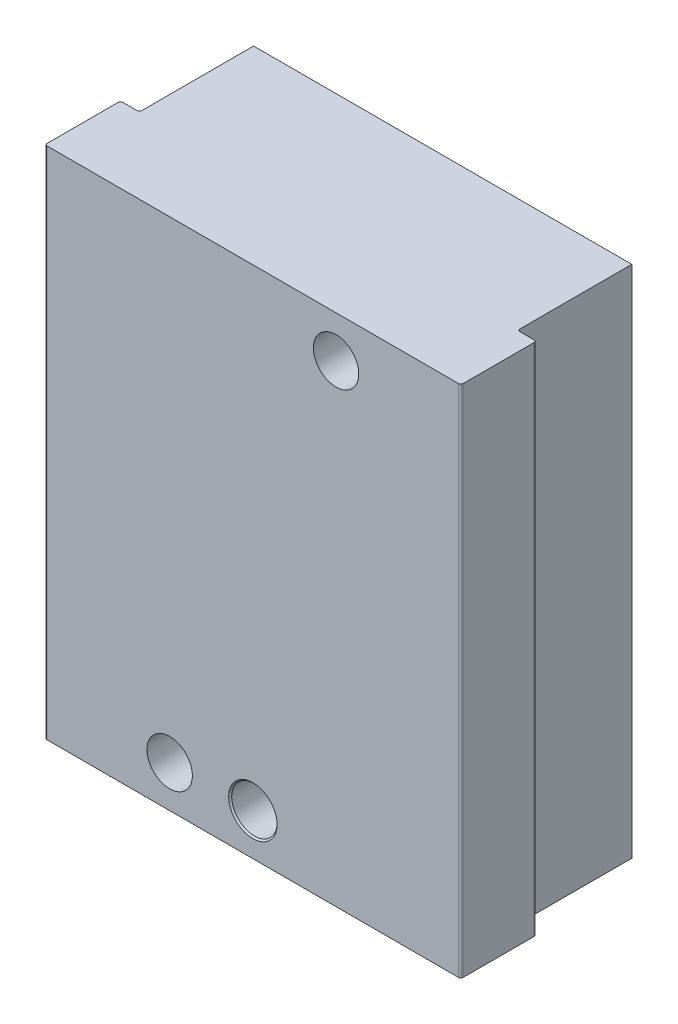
ISO-10303-21;
HEADER;
FILE_DESCRIPTION(('STEP AP214'),'2;1');
FILE_NAME('part.step','',(''),(''),'','','');
FILE_SCHEMA(('AUTOMOTIVE_DESIGN { 1 0 10303 214 1 1 1 1 }'));
ENDSEC;
DATA;
#1=APPLICATION_CONTEXT('core data for automotive mechanical design processes');
#2=APPLICATION_PROTOCOL_DEFINITION('international standard','automotive_design',2000,#1);
#3=PRODUCT_CONTEXT('',#1,'mechanical');
#4=PRODUCT('Part','Part','',(#3));
#5=PRODUCT_RELATED_PRODUCT_CATEGORY('part','',(#4));
#6=PRODUCT_DEFINITION_FORMATION('','',#4);
#7=PRODUCT_DEFINITION_CONTEXT('part definition',#1,'design');
#8=PRODUCT_DEFINITION('design','',#6,#7);
#9=PRODUCT_DEFINITION_SHAPE('','',#8);
#10=(LENGTH_UNIT() NAMED_UNIT(*) SI_UNIT(.MILLI.,.METRE.));
#11=(NAMED_UNIT(*) PLANE_ANGLE_UNIT() SI_UNIT($,.RADIAN.));
#12=(NAMED_UNIT(*) SI_UNIT($,.STERADIAN.) SOLID_ANGLE_UNIT());
#13=UNCERTAINTY_MEASURE_WITH_UNIT(LENGTH_MEASURE(1.E-05),#10,'distance_accuracy_value','');
#14=(GEOMETRIC_REPRESENTATION_CONTEXT(3) GLOBAL_UNCERTAINTY_ASSIGNED_CONTEXT((#13)) GLOBAL_UNIT_ASSIGNED_CONTEXT((#10,
#11,#12)) REPRESENTATION_CONTEXT('',''));
#15=CARTESIAN_POINT('',(0.,0.,0.));
#16=DIRECTION('',(0.,0.,1.));
#17=DIRECTION('',(1.,0.,0.));
#18=AXIS2_PLACEMENT_3D('',#15,#16,#17);
#19=CARTESIAN_POINT('',(0.,5.5,0.));
#20=DIRECTION('',(0.,0.,-1.));
#21=DIRECTION('',(-1.,0.,0.));
#22=AXIS2_PLACEMENT_3D('',#19,#20,#21);
#23=CYLINDRICAL_SURFACE('',#22,1.5);
#24=CARTESIAN_POINT('',(0.,5.5,-25.1));
#25=DIRECTION('',(0.,0.,-1.));
#26=DIRECTION('',(-1.,0.,0.));
#27=AXIS2_PLACEMENT_3D('',#24,#25,#26);
#28=CIRCLE('',#27,1.5);
#29=CARTESIAN_POINT('',(-1.5,5.5,-25.1));
#30=VERTEX_POINT('',#29);
#31=EDGE_CURVE('E248',#30,#30,#28,.T.);
#32=ORIENTED_EDGE('',*,*,#31,.T.);
#33=EDGE_LOOP('',(#32));
#34=FACE_BOUND('',#33,.T.);
#35=CARTESIAN_POINT('',(0.,5.5,-10.));
#36=DIRECTION('',(0.,0.,1.));
#37=DIRECTION('',(1.,0.,0.));
#38=AXIS2_PLACEMENT_3D('',#35,#36,#37);
#39=CIRCLE('',#38,1.5);
#40=CARTESIAN_POINT('',(1.5,5.5,-10.));
#41=VERTEX_POINT('',#40);
#42=EDGE_CURVE('E246',#41,#41,#39,.F.);
#43=ORIENTED_EDGE('',*,*,#42,.F.);
#44=EDGE_LOOP('',(#43));
#45=FACE_BOUND('',#44,.T.);
#46=ADVANCED_FACE('F32',(#34,#45),#23,.F.);
#47=CARTESIAN_POINT('',(27.5,68.,-10.));
#48=DIRECTION('',(-1.,0.,0.));
#49=DIRECTION('',(0.,0.,1.));
#50=AXIS2_PLACEMENT_3D('',#47,#48,#49);
#51=PLANE('',#50);
#52=DIRECTION('',(0.,0.,-1.));
#53=VECTOR('',#52,1.);
#54=CARTESIAN_POINT('',(27.5,0.,-10.));
#55=LINE('',#54,#53);
#56=CARTESIAN_POINT('',(27.5,0.,-0.3));
#57=VERTEX_POINT('',#56);
#58=CARTESIAN_POINT('',(27.5,0.,-9.7));
#59=VERTEX_POINT('',#58);
#60=EDGE_CURVE('E174',#57,#59,#55,.T.);
#61=ORIENTED_EDGE('',*,*,#60,.T.);
#62=DIRECTION('',(0.,-1.,0.));
#63=VECTOR('',#62,1.);
#64=CARTESIAN_POINT('',(27.5,68.,-9.7));
#65=LINE('',#64,#63);
#66=CARTESIAN_POINT('',(27.5,68.,-9.7));
#67=VERTEX_POINT('',#66);
#68=EDGE_CURVE('E212',#59,#67,#65,.F.);
#69=ORIENTED_EDGE('',*,*,#68,.T.);
#70=DIRECTION('',(0.,0.,-1.));
#71=VECTOR('',#70,1.);
#72=CARTESIAN_POINT('',(27.5,68.,-10.));
#73=LINE('',#72,#71);
#74=CARTESIAN_POINT('',(27.5,68.,-0.3));
#75=VERTEX_POINT('',#74);
#76=EDGE_CURVE('E195',#75,#67,#73,.T.);
#77=ORIENTED_EDGE('',*,*,#76,.F.);
#78=DIRECTION('',(0.,-1.,0.));
#79=VECTOR('',#78,1.);
#80=CARTESIAN_POINT('',(27.5,68.,-0.3));
#81=LINE('',#80,#79);
#82=EDGE_CURVE('E209',#75,#57,#81,.T.);
#83=ORIENTED_EDGE('',*,*,#82,.T.);
#84=EDGE_LOOP('',(#61,#69,#77,#83));
#85=FACE_BOUND('',#84,.T.);
#86=ADVANCED_FACE('F265',(#85),#51,.F.);
#87=CARTESIAN_POINT('',(27.5,68.,-10.));
#88=DIRECTION('',(0.,0.,1.));
#89=DIRECTION('',(1.,0.,0.));
#90=AXIS2_PLACEMENT_3D('',#87,#88,#89);
#91=PLANE('',#90);
#92=DIRECTION('',(-1.,0.,0.));
#93=VECTOR('',#92,1.);
#94=CARTESIAN_POINT('',(27.5,68.,-10.));
#95=LINE('',#94,#93);
#96=CARTESIAN_POINT('',(27.2,68.,-10.));
#97=VERTEX_POINT('',#96);
#98=CARTESIAN_POINT('',(25.3,68.,-10.));
#99=VERTEX_POINT('',#98);
#100=EDGE_CURVE('E147',#97,#99,#95,.T.);
#101=ORIENTED_EDGE('',*,*,#100,.F.);
#102=DIRECTION('',(0.,-1.,0.));
#103=VECTOR('',#102,1.);
#104=CARTESIAN_POINT('',(27.2,68.,-10.));
#105=LINE('',#104,#103);
#106=CARTESIAN_POINT('',(27.2,0.,-10.));
#107=VERTEX_POINT('',#106);
#108=EDGE_CURVE('E198',#97,#107,#105,.T.);
#109=ORIENTED_EDGE('',*,*,#108,.T.);
#110=DIRECTION('',(-1.,0.,0.));
#111=VECTOR('',#110,1.);
#112=CARTESIAN_POINT('',(27.5,0.,-10.));
#113=LINE('',#112,#111);
#114=CARTESIAN_POINT('',(25.3,0.,-10.));
#115=VERTEX_POINT('',#114);
#116=EDGE_CURVE('E177',#107,#115,#113,.T.);
#117=ORIENTED_EDGE('',*,*,#116,.T.);
#118=DIRECTION('',(0.,-1.,0.));
#119=VECTOR('',#118,1.);
#120=CARTESIAN_POINT('',(25.3,68.,-10.));
#121=LINE('',#120,#119);
#122=EDGE_CURVE('E156',#115,#99,#121,.F.);
#123=ORIENTED_EDGE('',*,*,#122,.T.);
#124=EDGE_LOOP('',(#101,#109,#117,#123));
#125=FACE_BOUND('',#124,.T.);
#126=ADVANCED_FACE('F271',(#125),#91,.F.);
#127=CARTESIAN_POINT('',(25.,68.,-25.1));
#128=DIRECTION('',(-1.,0.,0.));
#129=DIRECTION('',(0.,0.,1.));
#130=AXIS2_PLACEMENT_3D('',#127,#128,#129);
#131=PLANE('',#130);
#132=DIRECTION('',(0.,0.,-1.));
#133=VECTOR('',#132,1.);
#134=CARTESIAN_POINT('',(25.,68.,-25.1));
#135=LINE('',#134,#133);
#136=CARTESIAN_POINT('',(25.,68.,-10.3));
#137=VERTEX_POINT('',#136);
#138=CARTESIAN_POINT('',(25.,68.,-25.1));
#139=VERTEX_POINT('',#138);
#140=EDGE_CURVE('E133',#137,#139,#135,.T.);
#141=ORIENTED_EDGE('',*,*,#140,.F.);
#142=DIRECTION('',(0.,-1.,0.));
#143=VECTOR('',#142,1.);
#144=CARTESIAN_POINT('',(25.,0.,-10.3));
#145=LINE('',#144,#143);
#146=CARTESIAN_POINT('',(25.,0.,-10.3));
#147=VERTEX_POINT('',#146);
#148=EDGE_CURVE('E221',#137,#147,#145,.T.);
#149=ORIENTED_EDGE('',*,*,#148,.T.);
#150=DIRECTION('',(0.,0.,-1.));
#151=VECTOR('',#150,1.);
#152=CARTESIAN_POINT('',(25.,0.,-25.1));
#153=LINE('',#152,#151);
#154=CARTESIAN_POINT('',(25.,0.,-25.1));
#155=VERTEX_POINT('',#154);
#156=EDGE_CURVE('E153',#147,#155,#153,.T.);
#157=ORIENTED_EDGE('',*,*,#156,.T.);
#158=DIRECTION('',(0.,-1.,0.));
#159=VECTOR('',#158,1.);
#160=CARTESIAN_POINT('',(25.,68.,-25.1));
#161=LINE('',#160,#159);
#162=EDGE_CURVE('E150',#139,#155,#161,.T.);
#163=ORIENTED_EDGE('',*,*,#162,.F.);
#164=EDGE_LOOP('',(#141,#149,#157,#163));
#165=FACE_BOUND('',#164,.T.);
#166=ADVANCED_FACE('F151',(#165),#131,.F.);
#167=CARTESIAN_POINT('',(-25.,68.,-25.1));
#168=DIRECTION('',(0.,0.,1.));
#169=DIRECTION('',(1.,0.,0.));
#170=AXIS2_PLACEMENT_3D('',#167,#168,#169);
#171=PLANE('',#170);
#172=ORIENTED_EDGE('',*,*,#31,.F.);
#173=EDGE_LOOP('',(#172));
#174=FACE_BOUND('',#173,.T.);
#175=CARTESIAN_POINT('',(-11.,5.5,-25.1));
#176=DIRECTION('',(0.,0.,-1.));
#177=DIRECTION('',(-1.,0.,0.));
#178=AXIS2_PLACEMENT_3D('',#175,#176,#177);
#179=CIRCLE('',#178,3.);
#180=CARTESIAN_POINT('',(-14.,5.5,-25.1));
#181=VERTEX_POINT('',#180);
#182=EDGE_CURVE('E359',#181,#181,#179,.T.);
#183=ORIENTED_EDGE('',*,*,#182,.F.);
#184=EDGE_LOOP('',(#183));
#185=FACE_BOUND('',#184,.T.);
#186=CARTESIAN_POINT('',(11.,62.5,-25.1));
#187=DIRECTION('',(0.,0.,-1.));
#188=DIRECTION('',(-1.,0.,0.));
#189=AXIS2_PLACEMENT_3D('',#186,#187,#188);
#190=CIRCLE('',#189,3.);
#191=CARTESIAN_POINT('',(8.,62.5,-25.1));
#192=VERTEX_POINT('',#191);
#193=EDGE_CURVE('E353',#192,#192,#190,.T.);
#194=ORIENTED_EDGE('',*,*,#193,.F.);
#195=EDGE_LOOP('',(#194));
#196=FACE_BOUND('',#195,.T.);
#197=DIRECTION('',(-1.,0.,0.));
#198=VECTOR('',#197,1.);
#199=CARTESIAN_POINT('',(-25.,0.,-25.1));
#200=LINE('',#199,#198);
#201=CARTESIAN_POINT('',(-25.,0.,-25.1));
#202=VERTEX_POINT('',#201);
#203=EDGE_CURVE('E182',#155,#202,#200,.T.);
#204=ORIENTED_EDGE('',*,*,#203,.T.);
#205=DIRECTION('',(0.,-1.,0.));
#206=VECTOR('',#205,1.);
#207=CARTESIAN_POINT('',(-25.,68.,-25.1));
#208=LINE('',#207,#206);
#209=CARTESIAN_POINT('',(-25.,68.,-25.1));
#210=VERTEX_POINT('',#209);
#211=EDGE_CURVE('E157',#210,#202,#208,.T.);
#212=ORIENTED_EDGE('',*,*,#211,.F.);
#213=DIRECTION('',(-1.,0.,0.));
#214=VECTOR('',#213,1.);
#215=CARTESIAN_POINT('',(-25.,68.,-25.1));
#216=LINE('',#215,#214);
#217=EDGE_CURVE('E139',#139,#210,#216,.T.);
#218=ORIENTED_EDGE('',*,*,#217,.F.);
#219=ORIENTED_EDGE('',*,*,#162,.T.);
#220=EDGE_LOOP('',(#204,#212,#218,#219));
#221=FACE_BOUND('',#220,.T.);
#222=ADVANCED_FACE('F159',(#174,#185,#196,#221),#171,.F.);
#223=CARTESIAN_POINT('',(-25.,68.,-25.1));
#224=DIRECTION('',(1.,0.,0.));
#225=DIRECTION('',(0.,0.,-1.));
#226=AXIS2_PLACEMENT_3D('',#223,#224,#225);
#227=PLANE('',#226);
#228=DIRECTION('',(0.,0.,1.));
#229=VECTOR('',#228,1.);
#230=CARTESIAN_POINT('',(-25.,0.,-25.1));
#231=LINE('',#230,#229);
#232=CARTESIAN_POINT('',(-25.,0.,-10.3));
#233=VERTEX_POINT('',#232);
#234=EDGE_CURVE('E184',#202,#233,#231,.T.);
#235=ORIENTED_EDGE('',*,*,#234,.T.);
#236=DIRECTION('',(0.,-1.,0.));
#237=VECTOR('',#236,1.);
#238=CARTESIAN_POINT('',(-25.,68.,-10.3));
#239=LINE('',#238,#237);
#240=CARTESIAN_POINT('',(-25.,68.,-10.3));
#241=VERTEX_POINT('',#240);
#242=EDGE_CURVE('E228',#233,#241,#239,.F.);
#243=ORIENTED_EDGE('',*,*,#242,.T.);
#244=DIRECTION('',(0.,0.,1.));
#245=VECTOR('',#244,1.);
#246=CARTESIAN_POINT('',(-25.,68.,-25.1));
#247=LINE('',#246,#245);
#248=EDGE_CURVE('E162',#210,#241,#247,.T.);
#249=ORIENTED_EDGE('',*,*,#248,.F.);
#250=ORIENTED_EDGE('',*,*,#211,.T.);
#251=EDGE_LOOP('',(#235,#243,#249,#250));
#252=FACE_BOUND('',#251,.T.);
#253=ADVANCED_FACE('F305',(#252),#227,.F.);
#254=CARTESIAN_POINT('',(-27.5,68.,-10.));
#255=DIRECTION('',(0.,0.,1.));
#256=DIRECTION('',(1.,0.,0.));
#257=AXIS2_PLACEMENT_3D('',#254,#255,#256);
#258=PLANE('',#257);
#259=DIRECTION('',(-1.,0.,0.));
#260=VECTOR('',#259,1.);
#261=CARTESIAN_POINT('',(-27.5,68.,-10.));
#262=LINE('',#261,#260);
#263=CARTESIAN_POINT('',(-25.3,68.,-10.));
#264=VERTEX_POINT('',#263);
#265=CARTESIAN_POINT('',(-27.2,68.,-10.));
#266=VERTEX_POINT('',#265);
#267=EDGE_CURVE('E164',#264,#266,#262,.T.);
#268=ORIENTED_EDGE('',*,*,#267,.F.);
#269=DIRECTION('',(0.,-1.,0.));
#270=VECTOR('',#269,1.);
#271=CARTESIAN_POINT('',(-25.3,0.,-10.));
#272=LINE('',#271,#270);
#273=CARTESIAN_POINT('',(-25.3,0.,-10.));
#274=VERTEX_POINT('',#273);
#275=EDGE_CURVE('E225',#264,#274,#272,.T.);
#276=ORIENTED_EDGE('',*,*,#275,.T.);
#277=DIRECTION('',(-1.,0.,0.));
#278=VECTOR('',#277,1.);
#279=CARTESIAN_POINT('',(-27.5,0.,-10.));
#280=LINE('',#279,#278);
#281=CARTESIAN_POINT('',(-27.2,0.,-10.));
#282=VERTEX_POINT('',#281);
#283=EDGE_CURVE('E187',#274,#282,#280,.T.);
#284=ORIENTED_EDGE('',*,*,#283,.T.);
#285=DIRECTION('',(0.,-1.,0.));
#286=VECTOR('',#285,1.);
#287=CARTESIAN_POINT('',(-27.2,68.,-10.));
#288=LINE('',#287,#286);
#289=EDGE_CURVE('E223',#282,#266,#288,.F.);
#290=ORIENTED_EDGE('',*,*,#289,.T.);
#291=EDGE_LOOP('',(#268,#276,#284,#290));
#292=FACE_BOUND('',#291,.T.);
#293=ADVANCED_FACE('F301',(#292),#258,.F.);
#294=CARTESIAN_POINT('',(-27.5,68.,-10.));
#295=DIRECTION('',(1.,0.,0.));
#296=DIRECTION('',(0.,0.,-1.));
#297=AXIS2_PLACEMENT_3D('',#294,#295,#296);
#298=PLANE('',#297);
#299=DIRECTION('',(0.,0.,1.));
#300=VECTOR('',#299,1.);
#301=CARTESIAN_POINT('',(-27.5,68.,-10.));
#302=LINE('',#301,#300);
#303=CARTESIAN_POINT('',(-27.5,68.,-9.7));
#304=VERTEX_POINT('',#303);
#305=CARTESIAN_POINT('',(-27.5,68.,-0.3));
#306=VERTEX_POINT('',#305);
#307=EDGE_CURVE('E170',#304,#306,#302,.T.);
#308=ORIENTED_EDGE('',*,*,#307,.F.);
#309=DIRECTION('',(0.,-1.,0.));
#310=VECTOR('',#309,1.);
#311=CARTESIAN_POINT('',(-27.5,68.,-9.7));
#312=LINE('',#311,#310);
#313=CARTESIAN_POINT('',(-27.5,0.,-9.7));
#314=VERTEX_POINT('',#313);
#315=EDGE_CURVE('E232',#304,#314,#312,.T.);
#316=ORIENTED_EDGE('',*,*,#315,.T.);
#317=DIRECTION('',(0.,0.,1.));
#318=VECTOR('',#317,1.);
#319=CARTESIAN_POINT('',(-27.5,0.,-10.));
#320=LINE('',#319,#318);
#321=CARTESIAN_POINT('',(-27.5,0.,-0.3));
#322=VERTEX_POINT('',#321);
#323=EDGE_CURVE('E190',#314,#322,#320,.T.);
#324=ORIENTED_EDGE('',*,*,#323,.T.);
#325=DIRECTION('',(0.,-1.,0.));
#326=VECTOR('',#325,1.);
#327=CARTESIAN_POINT('',(-27.5,68.,-0.3));
#328=LINE('',#327,#326);
#329=EDGE_CURVE('E230',#322,#306,#328,.F.);
#330=ORIENTED_EDGE('',*,*,#329,.T.);
#331=EDGE_LOOP('',(#308,#316,#324,#330));
#332=FACE_BOUND('',#331,.T.);
#333=ADVANCED_FACE('F297',(#332),#298,.F.);
#334=CARTESIAN_POINT('',(-27.5,68.,0.));
#335=DIRECTION('',(0.,0.,-1.));
#336=DIRECTION('',(-1.,0.,0.));
#337=AXIS2_PLACEMENT_3D('',#334,#335,#336);
#338=PLANE('',#337);
#339=CARTESIAN_POINT('',(0.,5.5,0.));
#340=DIRECTION('',(0.,0.,-1.));
#341=DIRECTION('',(-1.,0.,0.));
#342=AXIS2_PLACEMENT_3D('',#339,#340,#341);
#343=CIRCLE('',#342,3.19999999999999);
#344=CARTESIAN_POINT('',(-3.19999999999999,5.5,0.));
#345=VERTEX_POINT('',#344);
#346=EDGE_CURVE('E11',#345,#345,#343,.T.);
#347=ORIENTED_EDGE('',*,*,#346,.T.);
#348=EDGE_LOOP('',(#347));
#349=FACE_BOUND('',#348,.T.);
#350=CARTESIAN_POINT('',(-11.,5.5,0.));
#351=DIRECTION('',(0.,0.,-1.));
#352=DIRECTION('',(-1.,0.,0.));
#353=AXIS2_PLACEMENT_3D('',#350,#351,#352);
#354=CIRCLE('',#353,3.);
#355=CARTESIAN_POINT('',(-14.,5.5,0.));
#356=VERTEX_POINT('',#355);
#357=EDGE_CURVE('E356',#356,#356,#354,.T.);
#358=ORIENTED_EDGE('',*,*,#357,.T.);
#359=EDGE_LOOP('',(#358));
#360=FACE_BOUND('',#359,.T.);
#361=CARTESIAN_POINT('',(11.,62.5,0.));
#362=DIRECTION('',(0.,0.,-1.));
#363=DIRECTION('',(-1.,0.,0.));
#364=AXIS2_PLACEMENT_3D('',#361,#362,#363);
#365=CIRCLE('',#364,3.);
#366=CARTESIAN_POINT('',(8.,62.5,0.));
#367=VERTEX_POINT('',#366);
#368=EDGE_CURVE('E178',#367,#367,#365,.T.);
#369=ORIENTED_EDGE('',*,*,#368,.T.);
#370=EDGE_LOOP('',(#369));
#371=FACE_BOUND('',#370,.T.);
#372=DIRECTION('',(1.,0.,0.));
#373=VECTOR('',#372,1.);
#374=CARTESIAN_POINT('',(-27.5,0.,0.));
#375=LINE('',#374,#373);
#376=CARTESIAN_POINT('',(-27.2,0.,0.));
#377=VERTEX_POINT('',#376);
#378=CARTESIAN_POINT('',(27.2,0.,0.));
#379=VERTEX_POINT('',#378);
#380=EDGE_CURVE('E193',#377,#379,#375,.T.);
#381=ORIENTED_EDGE('',*,*,#380,.T.);
#382=DIRECTION('',(0.,-1.,0.));
#383=VECTOR('',#382,1.);
#384=CARTESIAN_POINT('',(27.2,68.,0.));
#385=LINE('',#384,#383);
#386=CARTESIAN_POINT('',(27.2,68.,0.));
#387=VERTEX_POINT('',#386);
#388=EDGE_CURVE('E47',#379,#387,#385,.F.);
#389=ORIENTED_EDGE('',*,*,#388,.T.);
#390=DIRECTION('',(1.,0.,0.));
#391=VECTOR('',#390,1.);
#392=CARTESIAN_POINT('',(-27.5,68.,0.));
#393=LINE('',#392,#391);
#394=CARTESIAN_POINT('',(-27.2,68.,0.));
#395=VERTEX_POINT('',#394);
#396=EDGE_CURVE('E172',#395,#387,#393,.T.);
#397=ORIENTED_EDGE('',*,*,#396,.F.);
#398=DIRECTION('',(0.,-1.,0.));
#399=VECTOR('',#398,1.);
#400=CARTESIAN_POINT('',(-27.2,68.,0.));
#401=LINE('',#400,#399);
#402=EDGE_CURVE('E235',#395,#377,#401,.T.);
#403=ORIENTED_EDGE('',*,*,#402,.T.);
#404=EDGE_LOOP('',(#381,#389,#397,#403));
#405=FACE_BOUND('',#404,.T.);
#406=ADVANCED_FACE('F290',(#349,#360,#371,#405),#338,.F.);
#407=CARTESIAN_POINT('',(0.,68.,0.));
#408=DIRECTION('',(0.,1.,0.));
#409=DIRECTION('',(0.,0.,1.));
#410=AXIS2_PLACEMENT_3D('',#407,#408,#409);
#411=PLANE('',#410);
#412=ORIENTED_EDGE('',*,*,#76,.T.);
#413=CARTESIAN_POINT('',(27.2,68.,-9.7));
#414=DIRECTION('',(0.,1.,0.));
#415=DIRECTION('',(0.,0.,1.));
#416=AXIS2_PLACEMENT_3D('',#413,#414,#415);
#417=CIRCLE('',#416,0.3);
#418=EDGE_CURVE('E219',#67,#97,#417,.T.);
#419=ORIENTED_EDGE('',*,*,#418,.T.);
#420=ORIENTED_EDGE('',*,*,#100,.T.);
#421=CARTESIAN_POINT('',(25.3,68.,-10.3));
#422=DIRECTION('',(0.,1.,0.));
#423=DIRECTION('',(0.,0.,1.));
#424=AXIS2_PLACEMENT_3D('',#421,#422,#423);
#425=CIRCLE('',#424,0.3);
#426=EDGE_CURVE('E143',#99,#137,#425,.F.);
#427=ORIENTED_EDGE('',*,*,#426,.T.);
#428=ORIENTED_EDGE('',*,*,#140,.T.);
#429=ORIENTED_EDGE('',*,*,#217,.T.);
#430=ORIENTED_EDGE('',*,*,#248,.T.);
#431=CARTESIAN_POINT('',(-25.3,68.,-10.3));
#432=DIRECTION('',(0.,1.,0.));
#433=DIRECTION('',(0.,0.,1.));
#434=AXIS2_PLACEMENT_3D('',#431,#432,#433);
#435=CIRCLE('',#434,0.3);
#436=EDGE_CURVE('E244',#241,#264,#435,.F.);
#437=ORIENTED_EDGE('',*,*,#436,.T.);
#438=ORIENTED_EDGE('',*,*,#267,.T.);
#439=CARTESIAN_POINT('',(-27.2,68.,-9.7));
#440=DIRECTION('',(0.,1.,0.));
#441=DIRECTION('',(0.,0.,1.));
#442=AXIS2_PLACEMENT_3D('',#439,#440,#441);
#443=CIRCLE('',#442,0.3);
#444=EDGE_CURVE('E217',#266,#304,#443,.T.);
#445=ORIENTED_EDGE('',*,*,#444,.T.);
#446=ORIENTED_EDGE('',*,*,#307,.T.);
#447=CARTESIAN_POINT('',(-27.2,68.,-0.3));
#448=DIRECTION('',(0.,1.,0.));
#449=DIRECTION('',(0.,0.,1.));
#450=AXIS2_PLACEMENT_3D('',#447,#448,#449);
#451=CIRCLE('',#450,0.3);
#452=EDGE_CURVE('E54',#306,#395,#451,.T.);
#453=ORIENTED_EDGE('',*,*,#452,.T.);
#454=ORIENTED_EDGE('',*,*,#396,.T.);
#455=CARTESIAN_POINT('',(27.2,68.,-0.3));
#456=DIRECTION('',(0.,1.,0.));
#457=DIRECTION('',(0.,0.,1.));
#458=AXIS2_PLACEMENT_3D('',#455,#456,#457);
#459=CIRCLE('',#458,0.3);
#460=EDGE_CURVE('E215',#387,#75,#459,.T.);
#461=ORIENTED_EDGE('',*,*,#460,.T.);
#462=EDGE_LOOP('',(#412,#419,#420,#427,#428,#429,#430,#437,#438,#445,#446,#453,#454,#461));
#463=FACE_BOUND('',#462,.T.);
#464=ADVANCED_FACE('F136',(#463),#411,.T.);
#465=CARTESIAN_POINT('',(0.,0.,0.));
#466=DIRECTION('',(0.,1.,0.));
#467=DIRECTION('',(0.,0.,1.));
#468=AXIS2_PLACEMENT_3D('',#465,#466,#467);
#469=PLANE('',#468);
#470=ORIENTED_EDGE('',*,*,#116,.F.);
#471=CARTESIAN_POINT('',(27.2,0.,-9.7));
#472=DIRECTION('',(0.,1.,0.));
#473=DIRECTION('',(0.,0.,1.));
#474=AXIS2_PLACEMENT_3D('',#471,#472,#473);
#475=CIRCLE('',#474,0.3);
#476=EDGE_CURVE('E207',#107,#59,#475,.F.);
#477=ORIENTED_EDGE('',*,*,#476,.T.);
#478=ORIENTED_EDGE('',*,*,#60,.F.);
#479=CARTESIAN_POINT('',(27.2,0.,-0.3));
#480=DIRECTION('',(0.,1.,0.));
#481=DIRECTION('',(0.,0.,1.));
#482=AXIS2_PLACEMENT_3D('',#479,#480,#481);
#483=CIRCLE('',#482,0.3);
#484=EDGE_CURVE('E203',#57,#379,#483,.F.);
#485=ORIENTED_EDGE('',*,*,#484,.T.);
#486=ORIENTED_EDGE('',*,*,#380,.F.);
#487=CARTESIAN_POINT('',(-27.2,0.,-0.3));
#488=DIRECTION('',(0.,1.,0.));
#489=DIRECTION('',(0.,0.,1.));
#490=AXIS2_PLACEMENT_3D('',#487,#488,#489);
#491=CIRCLE('',#490,0.3);
#492=EDGE_CURVE('E201',#377,#322,#491,.F.);
#493=ORIENTED_EDGE('',*,*,#492,.T.);
#494=ORIENTED_EDGE('',*,*,#323,.F.);
#495=CARTESIAN_POINT('',(-27.2,0.,-9.7));
#496=DIRECTION('',(0.,1.,0.));
#497=DIRECTION('',(0.,0.,1.));
#498=AXIS2_PLACEMENT_3D('',#495,#496,#497);
#499=CIRCLE('',#498,0.3);
#500=EDGE_CURVE('E205',#314,#282,#499,.F.);
#501=ORIENTED_EDGE('',*,*,#500,.T.);
#502=ORIENTED_EDGE('',*,*,#283,.F.);
#503=CARTESIAN_POINT('',(-25.3,0.,-10.3));
#504=DIRECTION('',(0.,1.,0.));
#505=DIRECTION('',(0.,0.,1.));
#506=AXIS2_PLACEMENT_3D('',#503,#504,#505);
#507=CIRCLE('',#506,0.3);
#508=EDGE_CURVE('E242',#274,#233,#507,.T.);
#509=ORIENTED_EDGE('',*,*,#508,.T.);
#510=ORIENTED_EDGE('',*,*,#234,.F.);
#511=ORIENTED_EDGE('',*,*,#203,.F.);
#512=ORIENTED_EDGE('',*,*,#156,.F.);
#513=CARTESIAN_POINT('',(25.3,0.,-10.3));
#514=DIRECTION('',(0.,1.,0.));
#515=DIRECTION('',(0.,0.,1.));
#516=AXIS2_PLACEMENT_3D('',#513,#514,#515);
#517=CIRCLE('',#516,0.3);
#518=EDGE_CURVE('E239',#147,#115,#517,.T.);
#519=ORIENTED_EDGE('',*,*,#518,.T.);
#520=EDGE_LOOP('',(#470,#477,#478,#485,#486,#493,#494,#501,#502,#509,#510,#511,#512,#519));
#521=FACE_BOUND('',#520,.T.);
#522=ADVANCED_FACE('F289',(#521),#469,.F.);
#523=CARTESIAN_POINT('',(27.2,68.,-9.7));
#524=DIRECTION('',(0.,-1.,0.));
#525=DIRECTION('',(0.,0.,-1.));
#526=AXIS2_PLACEMENT_3D('',#523,#524,#525);
#527=CYLINDRICAL_SURFACE('',#526,0.3);
#528=ORIENTED_EDGE('',*,*,#418,.F.);
#529=ORIENTED_EDGE('',*,*,#68,.F.);
#530=ORIENTED_EDGE('',*,*,#476,.F.);
#531=ORIENTED_EDGE('',*,*,#108,.F.);
#532=EDGE_LOOP('',(#528,#529,#530,#531));
#533=FACE_BOUND('',#532,.T.);
#534=ADVANCED_FACE('F293',(#533),#527,.T.);
#535=CARTESIAN_POINT('',(25.3,68.,-10.3));
#536=DIRECTION('',(0.,1.,0.));
#537=DIRECTION('',(0.,0.,1.));
#538=AXIS2_PLACEMENT_3D('',#535,#536,#537);
#539=CYLINDRICAL_SURFACE('',#538,0.3);
#540=ORIENTED_EDGE('',*,*,#426,.F.);
#541=ORIENTED_EDGE('',*,*,#122,.F.);
#542=ORIENTED_EDGE('',*,*,#518,.F.);
#543=ORIENTED_EDGE('',*,*,#148,.F.);
#544=EDGE_LOOP('',(#540,#541,#542,#543));
#545=FACE_BOUND('',#544,.T.);
#546=ADVANCED_FACE('F320',(#545),#539,.F.);
#547=CARTESIAN_POINT('',(-25.3,68.,-10.3));
#548=DIRECTION('',(0.,1.,0.));
#549=DIRECTION('',(0.,0.,1.));
#550=AXIS2_PLACEMENT_3D('',#547,#548,#549);
#551=CYLINDRICAL_SURFACE('',#550,0.3);
#552=ORIENTED_EDGE('',*,*,#436,.F.);
#553=ORIENTED_EDGE('',*,*,#242,.F.);
#554=ORIENTED_EDGE('',*,*,#508,.F.);
#555=ORIENTED_EDGE('',*,*,#275,.F.);
#556=EDGE_LOOP('',(#552,#553,#554,#555));
#557=FACE_BOUND('',#556,.T.);
#558=ADVANCED_FACE('F324',(#557),#551,.F.);
#559=CARTESIAN_POINT('',(-27.2,68.,-9.7));
#560=DIRECTION('',(0.,-1.,0.));
#561=DIRECTION('',(0.,0.,-1.));
#562=AXIS2_PLACEMENT_3D('',#559,#560,#561);
#563=CYLINDRICAL_SURFACE('',#562,0.3);
#564=ORIENTED_EDGE('',*,*,#444,.F.);
#565=ORIENTED_EDGE('',*,*,#289,.F.);
#566=ORIENTED_EDGE('',*,*,#500,.F.);
#567=ORIENTED_EDGE('',*,*,#315,.F.);
#568=EDGE_LOOP('',(#564,#565,#566,#567));
#569=FACE_BOUND('',#568,.T.);
#570=ADVANCED_FACE('F328',(#569),#563,.T.);
#571=CARTESIAN_POINT('',(27.2,68.,-0.3));
#572=DIRECTION('',(0.,-1.,0.));
#573=DIRECTION('',(0.,0.,-1.));
#574=AXIS2_PLACEMENT_3D('',#571,#572,#573);
#575=CYLINDRICAL_SURFACE('',#574,0.3);
#576=ORIENTED_EDGE('',*,*,#460,.F.);
#577=ORIENTED_EDGE('',*,*,#388,.F.);
#578=ORIENTED_EDGE('',*,*,#484,.F.);
#579=ORIENTED_EDGE('',*,*,#82,.F.);
#580=EDGE_LOOP('',(#576,#577,#578,#579));
#581=FACE_BOUND('',#580,.T.);
#582=ADVANCED_FACE('F332',(#581),#575,.T.);
#583=CARTESIAN_POINT('',(-27.2,68.,-0.3));
#584=DIRECTION('',(0.,-1.,0.));
#585=DIRECTION('',(0.,0.,-1.));
#586=AXIS2_PLACEMENT_3D('',#583,#584,#585);
#587=CYLINDRICAL_SURFACE('',#586,0.3);
#588=ORIENTED_EDGE('',*,*,#452,.F.);
#589=ORIENTED_EDGE('',*,*,#329,.F.);
#590=ORIENTED_EDGE('',*,*,#492,.F.);
#591=ORIENTED_EDGE('',*,*,#402,.F.);
#592=EDGE_LOOP('',(#588,#589,#590,#591));
#593=FACE_BOUND('',#592,.T.);
#594=ADVANCED_FACE('F285',(#593),#587,.T.);
#595=CARTESIAN_POINT('',(11.,62.5,0.));
#596=DIRECTION('',(0.,0.,-1.));
#597=DIRECTION('',(-1.,0.,0.));
#598=AXIS2_PLACEMENT_3D('',#595,#596,#597);
#599=CYLINDRICAL_SURFACE('',#598,3.);
#600=ORIENTED_EDGE('',*,*,#368,.F.);
#601=EDGE_LOOP('',(#600));
#602=FACE_BOUND('',#601,.T.);
#603=ORIENTED_EDGE('',*,*,#193,.T.);
#604=EDGE_LOOP('',(#603));
#605=FACE_BOUND('',#604,.T.);
#606=ADVANCED_FACE('F281',(#602,#605),#599,.F.);
#607=CARTESIAN_POINT('',(-11.,5.5,0.));
#608=DIRECTION('',(0.,0.,-1.));
#609=DIRECTION('',(-1.,0.,0.));
#610=AXIS2_PLACEMENT_3D('',#607,#608,#609);
#611=CYLINDRICAL_SURFACE('',#610,3.);
#612=ORIENTED_EDGE('',*,*,#357,.F.);
#613=EDGE_LOOP('',(#612));
#614=FACE_BOUND('',#613,.T.);
#615=ORIENTED_EDGE('',*,*,#182,.T.);
#616=EDGE_LOOP('',(#615));
#617=FACE_BOUND('',#616,.T.);
#618=ADVANCED_FACE('F278',(#614,#617),#611,.F.);
#619=CARTESIAN_POINT('',(0.,5.5,-10.));
#620=DIRECTION('',(0.,0.,1.));
#621=DIRECTION('',(1.,0.,0.));
#622=AXIS2_PLACEMENT_3D('',#619,#620,#621);
#623=PLANE('',#622);
#624=CARTESIAN_POINT('',(0.,5.5,-10.));
#625=DIRECTION('',(0.,0.,1.));
#626=DIRECTION('',(1.,0.,0.));
#627=AXIS2_PLACEMENT_3D('',#624,#625,#626);
#628=CIRCLE('',#627,3.);
#629=CARTESIAN_POINT('',(3.,5.5,-10.));
#630=VERTEX_POINT('',#629);
#631=EDGE_CURVE('E249',#630,#630,#628,.T.);
#632=ORIENTED_EDGE('',*,*,#631,.T.);
#633=EDGE_LOOP('',(#632));
#634=FACE_BOUND('',#633,.T.);
#635=ORIENTED_EDGE('',*,*,#42,.T.);
#636=EDGE_LOOP('',(#635));
#637=FACE_BOUND('',#636,.T.);
#638=ADVANCED_FACE('F261',(#634,#637),#623,.T.);
#639=CARTESIAN_POINT('',(0.,5.5,-10.));
#640=DIRECTION('',(0.,0.,1.));
#641=DIRECTION('',(1.,0.,0.));
#642=AXIS2_PLACEMENT_3D('',#639,#640,#641);
#643=CYLINDRICAL_SURFACE('',#642,3.);
#644=CARTESIAN_POINT('',(0.,5.5,-0.200000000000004));
#645=DIRECTION('',(0.,0.,-1.));
#646=DIRECTION('',(-1.,0.,0.));
#647=AXIS2_PLACEMENT_3D('',#644,#645,#646);
#648=CIRCLE('',#647,3.);
#649=CARTESIAN_POINT('',(-3.,5.5,-0.200000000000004));
#650=VERTEX_POINT('',#649);
#651=EDGE_CURVE('E40',#650,#650,#648,.F.);
#652=ORIENTED_EDGE('',*,*,#651,.T.);
#653=EDGE_LOOP('',(#652));
#654=FACE_BOUND('',#653,.T.);
#655=ORIENTED_EDGE('',*,*,#631,.F.);
#656=EDGE_LOOP('',(#655));
#657=FACE_BOUND('',#656,.T.);
#658=ADVANCED_FACE('F253',(#654,#657),#643,.F.);
#659=CARTESIAN_POINT('',(0.,5.5,-0.200000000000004));
#660=DIRECTION('',(0.,0.,1.));
#661=DIRECTION('',(1.,0.,0.));
#662=AXIS2_PLACEMENT_3D('',#659,#660,#661);
#663=CONICAL_SURFACE('',#662,3.,0.785398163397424);
#664=ORIENTED_EDGE('',*,*,#346,.F.);
#665=EDGE_LOOP('',(#664));
#666=FACE_BOUND('',#665,.T.);
#667=ORIENTED_EDGE('',*,*,#651,.F.);
#668=EDGE_LOOP('',(#667));
#669=FACE_BOUND('',#668,.T.);
#670=ADVANCED_FACE('F34',(#666,#669),#663,.F.);
#671=CLOSED_SHELL('',(#46,#86,#126,#166,#222,#253,#293,#333,#406,#464,#522,#534,#546,#558,#570,
#582,#594,#606,#618,#638,#658,#670));
#672=MANIFOLD_SOLID_BREP('B2',#671);
#673=ADVANCED_BREP_SHAPE_REPRESENTATION('',(#18,#672),#14);
#674=SHAPE_DEFINITION_REPRESENTATION(#9,#673);
ENDSEC;
END-ISO-10303-21;
